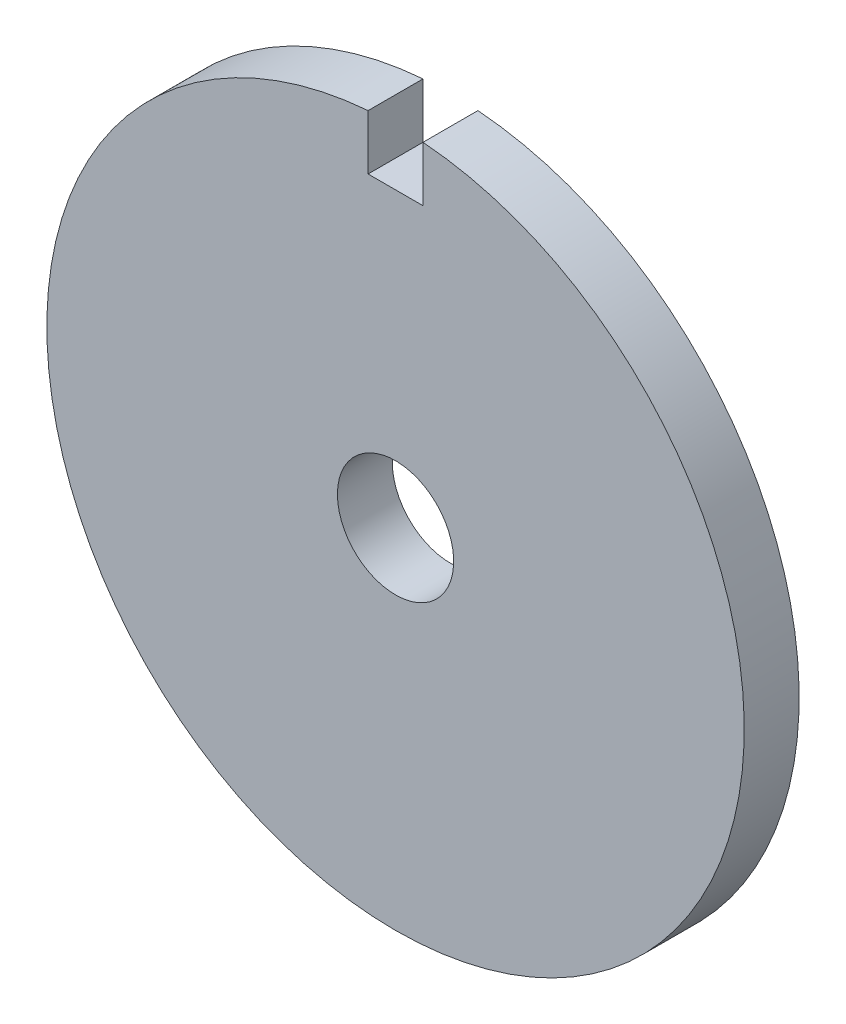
from build123d import *

# Parameters (mm, degrees)
SKETCH1_R               = 12.7
SKETCH1_R_2             = 3.175
BOSS_EXTRUDE1_DEPTH     = 2.99974
SKETCH1_4_R             = 19.05
SKETCH1_4_R_2           = 12.7
BOSS_EXTRUDE2_DEPTH     = 2.99974
CUT_EXTRUDE1_DEPTH      = 28.10725807
CUT_EXTRUDE1_DEPTH_BACK = 28.10725807
SKETCH2_W               = 3.000000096
SKETCH2_H               = 3.000000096


with BuildPart() as part:
    # Sketch1 → Boss-Extrude1 (new body)
    with BuildSketch(Plane.XY):
        with Locations(Location((0, 0, 0), (0, 0, 180))):
            Circle(SKETCH1_R)
        with Locations(Location((0, 0, 0), (0, 0, 180))):
            Circle(SKETCH1_R_2, mode=Mode.SUBTRACT)
    extrude(amount=BOSS_EXTRUDE1_DEPTH)

    # Sketch1_4 → Boss-Extrude2 (add)
    with BuildSketch(Plane.XY):
        with Locations(Location((0, 0, 0), (0, 0, 180))):
            Circle(SKETCH1_4_R)
        Circle(SKETCH1_4_R_2, mode=Mode.SUBTRACT)
    extrude(amount=BOSS_EXTRUDE2_DEPTH)

    # Sketch2 → Cut-Extrude1 (cut, two sides: drawn at the far end of the back side and taken through both)
    with BuildSketch(Plane(origin=(0, 0, 0), x_dir=(-1, 0, 0), z_dir=(0, 0, -1)).offset(-CUT_EXTRUDE1_DEPTH_BACK)):
        with Locations((0, 17.49085301)):
            Rectangle(SKETCH2_W, SKETCH2_H)
    extrude(amount=CUT_EXTRUDE1_DEPTH + CUT_EXTRUDE1_DEPTH_BACK, mode=Mode.SUBTRACT)


with BuildPart() as cut_extrude1_kept_piece:
    # of the separate pieces the step leaves, the one the design keeps (cut_extrude1_pieces_kept)
    add(part.part.solids().sort_by_distance((-3.175, 0, 0))[0])


solid = cut_extrude1_kept_piece.part
